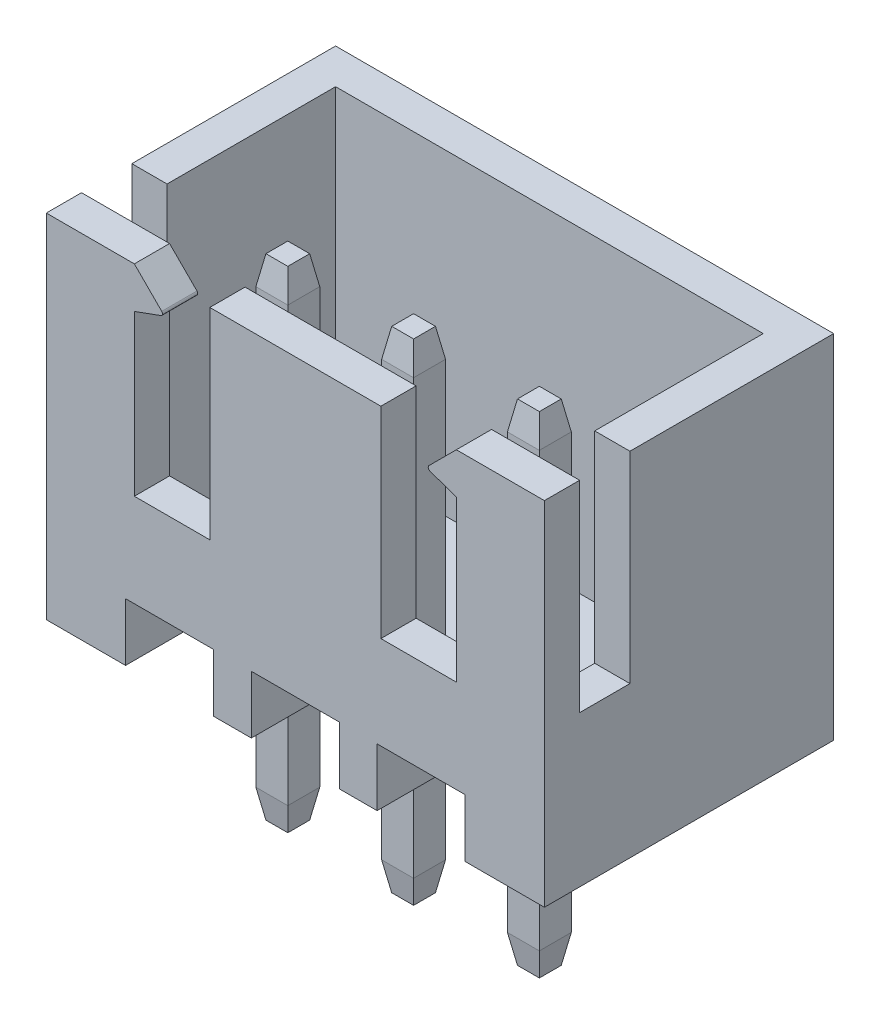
from build123d import *
from OCP.BRepFilletAPI import BRepFilletAPI_MakeChamfer

# Parameters (mm, degrees)
SKETCH1_W                               = 9.9
SKETCH1_H                               = 5.75
X_Y_Z_BODY_ENVELOPE_DEPTH               = 7
SHELL_NOM_6MM_THICK_T                   = -0.7
BODY_RELIEF_DEPTH                       = 0.875
LPATTERN2_BODY_RELIEF_COUNT             = 2
LPATTERN2_BODY_RELIEF_PITCH             = 2.5
LPATTERN2_BODY_RELIEF_COL_COUNT         = 2
LPATTERN2_BODY_RELIEF_COL_PITCH         = 2.5
FRONT_LOCKING_SLOT_DEPTH                = 0.7
F_025IN_START                           = -6.35
SKETCH3_W                               = 0.635
SKETCH3_H                               = 0.635
F_025IN_SQ_PIN_DEPTH                    = 9.75
CHAMFER7_SIZE                           = 0.1
CHAMFER7_SIZE2                          = 0.567128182
LPATTERN_ALL_PINS_COUNT                 = 2
LPATTERN_ALL_PINS_PITCH                 = 2.5
CHAMFER7_OF_LPATTERN_ALL_PINS_SIZE      = 0.1
CHAMFER7_OF_LPATTERN_ALL_PINS_SIZE2     = 0.567128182
LPATTERN_ALL_PINS_COL_COUNT             = 2
LPATTERN_ALL_PINS_COL_PITCH             = 2.5
CHAMFER7_OF_LPATTERN_ALL_PINS_COL_SIZE  = 0.1
CHAMFER7_OF_LPATTERN_ALL_PINS_COL_SIZE2 = 0.567128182
SKETCH4_W                               = 1
SKETCH4_H                               = 4
SIDE_SLOTS_DEPTH                        = 10
SKETCH6_R                               = 0.475
PIN_1_FOR_95MM_DIA_HOLE_DEPTH           = 1.5


with BuildPart() as part:
    # Sketch1 → X-Y-Z body envelope (new body)
    with BuildSketch(Plane(origin=(0, 0, 0), x_dir=(1, 0, 0), z_dir=(0, 1, 0))):
        Rectangle(SKETCH1_W, SKETCH1_H)
    extrude(amount=X_Y_Z_BODY_ENVELOPE_DEPTH)

    # Shell - nom. .6mm thick
    shell_nom_6mm_thick_openings = [part.faces().sort_by_distance(p)[0] for p in [
        (0, 7, 0),
    ]]
    offset(amount=SHELL_NOM_6MM_THICK_T, openings=shell_nom_6mm_thick_openings, kind=Kind.INTERSECTION)

    # Sketch5 → Body relief (cut, symmetric)
    with BuildSketch(Plane(origin=(0, 0, 0), x_dir=(0, 0, -1), z_dir=(1, 0, 0))):
        Polygon((-2.875, 0), (2.875, 0), (2.875, 1.15), (1.375, 0.1), (-1.375, 0.1), (-2.875, 1.15), align=None)
    body_relief = extrude(amount=BODY_RELIEF_DEPTH, both=True, mode=Mode.SUBTRACT)

    # LPattern2 - Body relief: Body relief ×2
    with Locations(*[(i * LPATTERN2_BODY_RELIEF_PITCH, 0, 0) for i in range(1, LPATTERN2_BODY_RELIEF_COUNT)]):
        add(body_relief, mode=Mode.SUBTRACT)

    # LPattern2 - Body relief col: Body relief ×2
    with Locations(*[(-i * LPATTERN2_BODY_RELIEF_COL_PITCH, 0, 0) for i in range(1, LPATTERN2_BODY_RELIEF_COL_COUNT)]):
        add(body_relief, mode=Mode.SUBTRACT)

    # Sketch2 → Front locking slot (cut)
    with BuildSketch(Plane.XY.offset(2.875)):
        with BuildLine():
            Line((1.7, 7), (1.7, 3))
            Line((1.7, 3), (3.2, 3))
            Line((3.2, 3), (3.2, 6.181617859))
            Line((3.2, 6.181617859), (2.673751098, 6.373156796))
            ThreePointArc((2.673751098, 6.373156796), (2.642037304, 6.409319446), (2.655496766, 6.455496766))
            Line((2.655496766, 6.455496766), (3.2, 7))
            Line((3.2, 7), (1.7, 7))
        make_face()
    front_locking_slot = extrude(amount=-FRONT_LOCKING_SLOT_DEPTH, mode=Mode.SUBTRACT)

    # Mirror5: Front locking slot across plane
    add(front_locking_slot.mirror(Plane(origin=(0, 0, 0), x_dir=(0, 0, 1), z_dir=(1, 0, 0))), mode=Mode.SUBTRACT)

    # Sketch3 → 025in Sq. pin (add)
    with BuildSketch(Plane.XZ.offset(F_025IN_START)):
        with Locations((0, 0.525)):
            Rectangle(SKETCH3_W, SKETCH3_H)
    f_025in_sq_pin = extrude(amount=F_025IN_SQ_PIN_DEPTH)

    # Chamfer7: one chamfer whose edges measure the first distance from different faces: ONE call of the kernel's chamfer builder (chamfer() names one face for all edges)
    chamfer7_edges_1 = [part.edges().sort_by_distance(p)[0] for p in [
        (-0.3175, 6.35, 0.525),
        (0, 6.35, 0.2075),
        (0.3175, 6.35, 0.525),
        (0, 6.35, 0.8425),
    ]]
    chamfer7_side_1 = [part.faces().sort_by_distance(p)[0] for p in [
        (0, 6.35, 0.525),
    ]]
    chamfer7_edges_2 = [part.edges().sort_by_distance(p)[0] for p in [
        (-0.3175, -3.4, 0.525),
        (0, -3.4, 0.2075),
        (0.3175, -3.4, 0.525),
        (0, -3.4, 0.8425),
    ]]
    chamfer7_side_2 = [part.faces().sort_by_distance(p)[0] for p in [
        (0, -3.4, 0.525),
    ]]
    chamfer7 = BRepFilletAPI_MakeChamfer(part.part.solid().wrapped)
    for e in chamfer7_edges_1:
        chamfer7.Add(CHAMFER7_SIZE, CHAMFER7_SIZE2, e.wrapped, chamfer7_side_1[0].wrapped)  # the first distance lies on this face
    for e in chamfer7_edges_2:
        chamfer7.Add(CHAMFER7_SIZE, CHAMFER7_SIZE2, e.wrapped, chamfer7_side_2[0].wrapped)  # the first distance lies on this face
    add(Compound.cast(chamfer7.Shape()), mode=Mode.REPLACE)

    # LPattern - All pins: 025in Sq. pin ×2
    with Locations(*[(i * LPATTERN_ALL_PINS_PITCH, 0, 0) for i in range(1, LPATTERN_ALL_PINS_COUNT)]):
        add(f_025in_sq_pin)

    # Chamfer7 of LPattern - All pins: one chamfer whose edges measure the first distance from different faces: ONE call of the kernel's chamfer builder (chamfer() names one face for all edges)
    chamfer7_of_lpattern_all_pins_edges_1 = [part.edges().sort_by_distance(p)[0] for p in [
        (2.1825, 6.35, 0.525),
        (2.5, 6.35, 0.2075),
        (2.8175, 6.35, 0.525),
        (2.5, 6.35, 0.8425),
    ]]
    chamfer7_of_lpattern_all_pins_side_1 = [part.faces().sort_by_distance(p)[0] for p in [
        (2.5, 6.35, 0.525),
    ]]
    chamfer7_of_lpattern_all_pins_edges_2 = [part.edges().sort_by_distance(p)[0] for p in [
        (2.1825, -3.4, 0.525),
        (2.5, -3.4, 0.2075),
        (2.8175, -3.4, 0.525),
        (2.5, -3.4, 0.8425),
    ]]
    chamfer7_of_lpattern_all_pins_side_2 = [part.faces().sort_by_distance(p)[0] for p in [
        (2.5, -3.4, 0.525),
    ]]
    chamfer7_of_lpattern_all_pins = BRepFilletAPI_MakeChamfer(part.part.solid().wrapped)
    for e in chamfer7_of_lpattern_all_pins_edges_1:
        chamfer7_of_lpattern_all_pins.Add(CHAMFER7_OF_LPATTERN_ALL_PINS_SIZE, CHAMFER7_OF_LPATTERN_ALL_PINS_SIZE2, e.wrapped, chamfer7_of_lpattern_all_pins_side_1[0].wrapped)  # the first distance lies on this face
    for e in chamfer7_of_lpattern_all_pins_edges_2:
        chamfer7_of_lpattern_all_pins.Add(CHAMFER7_OF_LPATTERN_ALL_PINS_SIZE, CHAMFER7_OF_LPATTERN_ALL_PINS_SIZE2, e.wrapped, chamfer7_of_lpattern_all_pins_side_2[0].wrapped)  # the first distance lies on this face
    add(Compound.cast(chamfer7_of_lpattern_all_pins.Shape()), mode=Mode.REPLACE)

    # LPattern - All pins col: 025in Sq. pin ×2
    with Locations(*[(-i * LPATTERN_ALL_PINS_COL_PITCH, 0, 0) for i in range(1, LPATTERN_ALL_PINS_COL_COUNT)]):
        add(f_025in_sq_pin)

    # Chamfer7 of LPattern - All pins col: one chamfer whose edges measure the first distance from different faces: ONE call of the kernel's chamfer builder (chamfer() names one face for all edges)
    chamfer7_of_lpattern_all_pins_col_edges_1 = [part.edges().sort_by_distance(p)[0] for p in [
        (-2.8175, 6.35, 0.525),
        (-2.5, 6.35, 0.2075),
        (-2.1825, 6.35, 0.525),
        (-2.5, 6.35, 0.8425),
    ]]
    chamfer7_of_lpattern_all_pins_col_side_1 = [part.faces().sort_by_distance(p)[0] for p in [
        (-2.5, 6.35, 0.525),
    ]]
    chamfer7_of_lpattern_all_pins_col_edges_2 = [part.edges().sort_by_distance(p)[0] for p in [
        (-2.8175, -3.4, 0.525),
        (-2.5, -3.4, 0.2075),
        (-2.1825, -3.4, 0.525),
        (-2.5, -3.4, 0.8425),
    ]]
    chamfer7_of_lpattern_all_pins_col_side_2 = [part.faces().sort_by_distance(p)[0] for p in [
        (-2.5, -3.4, 0.525),
    ]]
    chamfer7_of_lpattern_all_pins_col = BRepFilletAPI_MakeChamfer(part.part.solid().wrapped)
    for e in chamfer7_of_lpattern_all_pins_col_edges_1:
        chamfer7_of_lpattern_all_pins_col.Add(CHAMFER7_OF_LPATTERN_ALL_PINS_COL_SIZE, CHAMFER7_OF_LPATTERN_ALL_PINS_COL_SIZE2, e.wrapped, chamfer7_of_lpattern_all_pins_col_side_1[0].wrapped)  # the first distance lies on this face
    for e in chamfer7_of_lpattern_all_pins_col_edges_2:
        chamfer7_of_lpattern_all_pins_col.Add(CHAMFER7_OF_LPATTERN_ALL_PINS_COL_SIZE, CHAMFER7_OF_LPATTERN_ALL_PINS_COL_SIZE2, e.wrapped, chamfer7_of_lpattern_all_pins_col_side_2[0].wrapped)  # the first distance lies on this face
    add(Compound.cast(chamfer7_of_lpattern_all_pins_col.Shape()), mode=Mode.REPLACE)

    # Sketch4 → Side slots (cut, symmetric)
    with BuildSketch(Plane(origin=(0, 0, 0), x_dir=(0, 0, -1), z_dir=(1, 0, 0))):
        with Locations((-1.675, 5)):
            Rectangle(SKETCH4_W, SKETCH4_H)
    extrude(amount=SIDE_SLOTS_DEPTH, both=True, mode=Mode.SUBTRACT)

    # Sketch6 → Pin 1 for .95mm dia. hole (add)
    with BuildSketch(Plane.XZ):
        with Locations(Location((2.5, 0.525, 0), (0, 0, 270))):
            Circle(SKETCH6_R)
    extrude(amount=PIN_1_FOR_95MM_DIA_HOLE_DEPTH)


solid = part.part
